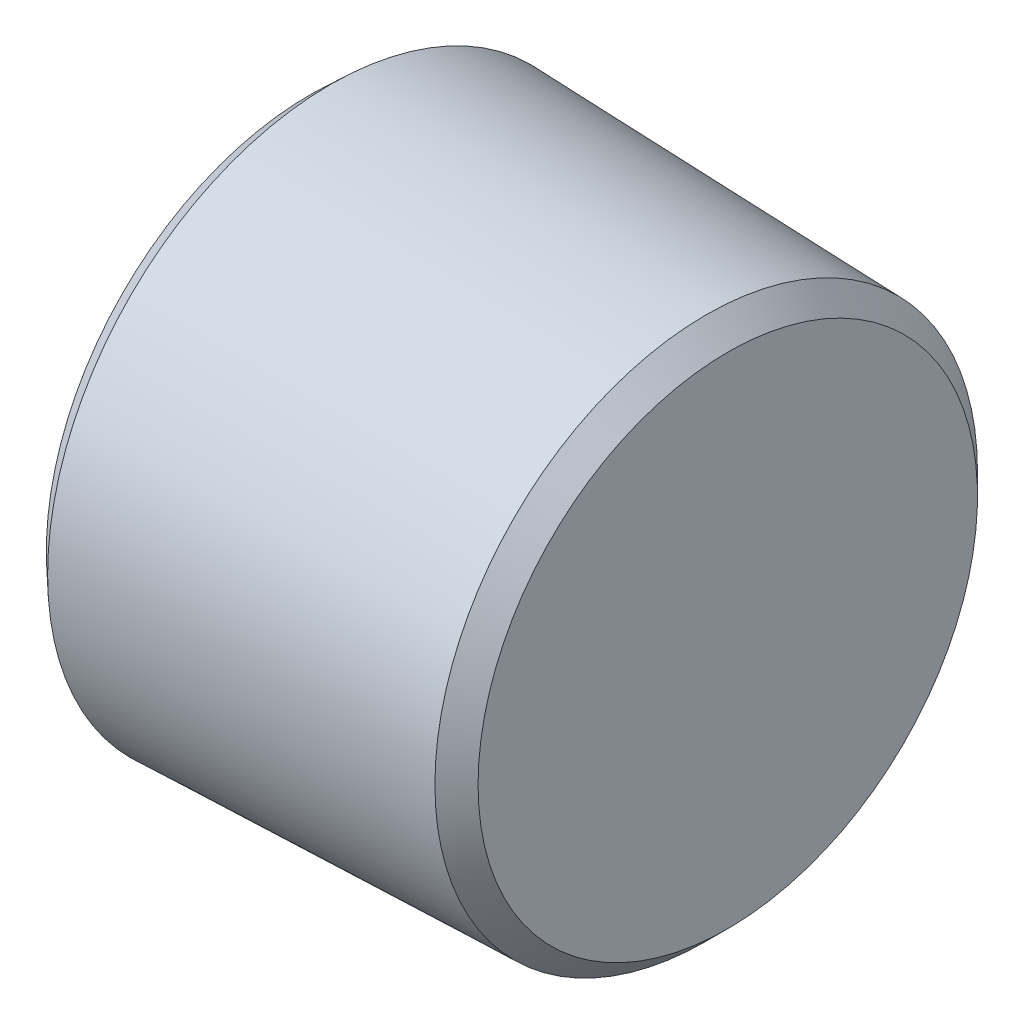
ISO-10303-21;
HEADER;
FILE_DESCRIPTION(('STEP AP214'),'2;1');
FILE_NAME('part.step','',(''),(''),'','','');
FILE_SCHEMA(('AUTOMOTIVE_DESIGN { 1 0 10303 214 1 1 1 1 }'));
ENDSEC;
DATA;
#1=APPLICATION_CONTEXT('core data for automotive mechanical design processes');
#2=APPLICATION_PROTOCOL_DEFINITION('international standard','automotive_design',2000,#1);
#3=PRODUCT_CONTEXT('',#1,'mechanical');
#4=PRODUCT('Part','Part','',(#3));
#5=PRODUCT_RELATED_PRODUCT_CATEGORY('part','',(#4));
#6=PRODUCT_DEFINITION_FORMATION('','',#4);
#7=PRODUCT_DEFINITION_CONTEXT('part definition',#1,'design');
#8=PRODUCT_DEFINITION('design','',#6,#7);
#9=PRODUCT_DEFINITION_SHAPE('','',#8);
#10=(LENGTH_UNIT() NAMED_UNIT(*) SI_UNIT(.MILLI.,.METRE.));
#11=(NAMED_UNIT(*) PLANE_ANGLE_UNIT() SI_UNIT($,.RADIAN.));
#12=(NAMED_UNIT(*) SI_UNIT($,.STERADIAN.) SOLID_ANGLE_UNIT());
#13=UNCERTAINTY_MEASURE_WITH_UNIT(LENGTH_MEASURE(1.E-05),#10,'distance_accuracy_value','');
#14=(GEOMETRIC_REPRESENTATION_CONTEXT(3) GLOBAL_UNCERTAINTY_ASSIGNED_CONTEXT((#13)) GLOBAL_UNIT_ASSIGNED_CONTEXT((#10,
#11,#12)) REPRESENTATION_CONTEXT('',''));
#15=CARTESIAN_POINT('',(0.,0.,0.));
#16=DIRECTION('',(0.,0.,1.));
#17=DIRECTION('',(1.,0.,0.));
#18=AXIS2_PLACEMENT_3D('',#15,#16,#17);
#19=CARTESIAN_POINT('',(3.5,1.73205080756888,-3.));
#20=DIRECTION('',(-1.,0.,0.));
#21=DIRECTION('',(0.,0.,1.));
#22=AXIS2_PLACEMENT_3D('',#19,#20,#21);
#23=PLANE('',#22);
#24=CARTESIAN_POINT('',(3.5,0.,0.));
#25=DIRECTION('',(-1.,0.,0.));
#26=DIRECTION('',(0.,0.,1.));
#27=AXIS2_PLACEMENT_3D('',#24,#25,#26);
#28=CIRCLE('',#27,3.);
#29=CARTESIAN_POINT('',(3.5,0.,3.));
#30=VERTEX_POINT('',#29);
#31=CARTESIAN_POINT('',(3.5,2.59807621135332,1.5));
#32=VERTEX_POINT('',#31);
#33=EDGE_CURVE('E109',#30,#32,#28,.T.);
#34=ORIENTED_EDGE('',*,*,#33,.F.);
#35=DIRECTION('',(0.,-1.,0.));
#36=VECTOR('',#35,1.);
#37=CARTESIAN_POINT('',(3.5,1.73205080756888,3.));
#38=LINE('',#37,#36);
#39=CARTESIAN_POINT('',(3.5,1.73205080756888,3.));
#40=VERTEX_POINT('',#39);
#41=EDGE_CURVE('E132',#40,#30,#38,.T.);
#42=ORIENTED_EDGE('',*,*,#41,.F.);
#43=DIRECTION('',(0.,-0.5,0.866025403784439));
#44=VECTOR('',#43,1.);
#45=CARTESIAN_POINT('',(3.5,3.46410161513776,0.));
#46=LINE('',#45,#44);
#47=EDGE_CURVE('E130',#32,#40,#46,.T.);
#48=ORIENTED_EDGE('',*,*,#47,.F.);
#49=EDGE_LOOP('',(#34,#42,#48));
#50=FACE_BOUND('',#49,.T.);
#51=ADVANCED_FACE('F29',(#50),#23,.T.);
#52=CARTESIAN_POINT('',(3.5,2.59807621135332,-1.5));
#53=VERTEX_POINT('',#52);
#54=EDGE_CURVE('E111',#32,#53,#28,.T.);
#55=ORIENTED_EDGE('',*,*,#54,.F.);
#56=CARTESIAN_POINT('',(3.5,3.46410161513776,0.));
#57=VERTEX_POINT('',#56);
#58=EDGE_CURVE('E124',#57,#32,#46,.T.);
#59=ORIENTED_EDGE('',*,*,#58,.F.);
#60=DIRECTION('',(0.,0.5,0.866025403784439));
#61=VECTOR('',#60,1.);
#62=CARTESIAN_POINT('',(3.5,1.73205080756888,-3.));
#63=LINE('',#62,#61);
#64=EDGE_CURVE('E126',#53,#57,#63,.T.);
#65=ORIENTED_EDGE('',*,*,#64,.F.);
#66=EDGE_LOOP('',(#55,#59,#65));
#67=FACE_BOUND('',#66,.T.);
#68=ADVANCED_FACE('F122',(#67),#23,.T.);
#69=CARTESIAN_POINT('',(3.5,0.,-3.));
#70=VERTEX_POINT('',#69);
#71=EDGE_CURVE('E129',#53,#70,#28,.T.);
#72=ORIENTED_EDGE('',*,*,#71,.F.);
#73=CARTESIAN_POINT('',(3.5,1.73205080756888,-3.));
#74=VERTEX_POINT('',#73);
#75=EDGE_CURVE('E135',#74,#53,#63,.T.);
#76=ORIENTED_EDGE('',*,*,#75,.F.);
#77=DIRECTION('',(0.,1.,0.));
#78=VECTOR('',#77,1.);
#79=CARTESIAN_POINT('',(3.5,-1.73205080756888,-3.));
#80=LINE('',#79,#78);
#81=EDGE_CURVE('E152',#70,#74,#80,.T.);
#82=ORIENTED_EDGE('',*,*,#81,.F.);
#83=EDGE_LOOP('',(#72,#76,#82));
#84=FACE_BOUND('',#83,.T.);
#85=ADVANCED_FACE('F215',(#84),#23,.T.);
#86=CARTESIAN_POINT('',(3.5,-2.59807621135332,-1.5));
#87=VERTEX_POINT('',#86);
#88=EDGE_CURVE('E217',#70,#87,#28,.T.);
#89=ORIENTED_EDGE('',*,*,#88,.F.);
#90=CARTESIAN_POINT('',(3.5,-1.73205080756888,-3.));
#91=VERTEX_POINT('',#90);
#92=EDGE_CURVE('E153',#91,#70,#80,.T.);
#93=ORIENTED_EDGE('',*,*,#92,.F.);
#94=DIRECTION('',(0.,0.5,-0.866025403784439));
#95=VECTOR('',#94,1.);
#96=CARTESIAN_POINT('',(3.5,-3.46410161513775,0.));
#97=LINE('',#96,#95);
#98=EDGE_CURVE('E148',#87,#91,#97,.T.);
#99=ORIENTED_EDGE('',*,*,#98,.F.);
#100=EDGE_LOOP('',(#89,#93,#99));
#101=FACE_BOUND('',#100,.T.);
#102=ADVANCED_FACE('F224',(#101),#23,.T.);
#103=CARTESIAN_POINT('',(3.5,-2.59807621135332,1.5));
#104=VERTEX_POINT('',#103);
#105=EDGE_CURVE('E44',#87,#104,#28,.T.);
#106=ORIENTED_EDGE('',*,*,#105,.F.);
#107=CARTESIAN_POINT('',(3.5,-3.46410161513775,0.));
#108=VERTEX_POINT('',#107);
#109=EDGE_CURVE('E149',#108,#87,#97,.T.);
#110=ORIENTED_EDGE('',*,*,#109,.F.);
#111=DIRECTION('',(0.,-0.5,-0.866025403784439));
#112=VECTOR('',#111,1.);
#113=CARTESIAN_POINT('',(3.5,-1.73205080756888,3.));
#114=LINE('',#113,#112);
#115=EDGE_CURVE('E144',#104,#108,#114,.T.);
#116=ORIENTED_EDGE('',*,*,#115,.F.);
#117=EDGE_LOOP('',(#106,#110,#116));
#118=FACE_BOUND('',#117,.T.);
#119=ADVANCED_FACE('F194',(#118),#23,.T.);
#120=CARTESIAN_POINT('',(0.,0.,0.));
#121=DIRECTION('',(1.,0.,0.));
#122=DIRECTION('',(0.,0.,-1.));
#123=AXIS2_PLACEMENT_3D('',#120,#121,#122);
#124=PLANE('',#123);
#125=CARTESIAN_POINT('',(0.,0.,0.));
#126=DIRECTION('',(1.,0.,0.));
#127=DIRECTION('',(0.,0.,-1.));
#128=AXIS2_PLACEMENT_3D('',#125,#126,#127);
#129=CIRCLE('',#128,6.30091483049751);
#130=CARTESIAN_POINT('',(0.,0.,-6.30091483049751));
#131=VERTEX_POINT('',#130);
#132=EDGE_CURVE('E11',#131,#131,#129,.F.);
#133=ORIENTED_EDGE('',*,*,#132,.T.);
#134=EDGE_LOOP('',(#133));
#135=FACE_BOUND('',#134,.T.);
#136=DIRECTION('',(0.,0.5,0.866025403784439));
#137=VECTOR('',#136,1.);
#138=CARTESIAN_POINT('',(0.,1.73205080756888,-3.));
#139=LINE('',#138,#137);
#140=CARTESIAN_POINT('',(0.,1.73205080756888,-3.));
#141=VERTEX_POINT('',#140);
#142=CARTESIAN_POINT('',(0.,3.46410161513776,0.));
#143=VERTEX_POINT('',#142);
#144=EDGE_CURVE('E52',#141,#143,#139,.T.);
#145=ORIENTED_EDGE('',*,*,#144,.T.);
#146=DIRECTION('',(0.,-0.5,0.866025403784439));
#147=VECTOR('',#146,1.);
#148=CARTESIAN_POINT('',(0.,3.46410161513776,0.));
#149=LINE('',#148,#147);
#150=CARTESIAN_POINT('',(0.,1.73205080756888,3.));
#151=VERTEX_POINT('',#150);
#152=EDGE_CURVE('E198',#143,#151,#149,.T.);
#153=ORIENTED_EDGE('',*,*,#152,.T.);
#154=DIRECTION('',(0.,-1.,0.));
#155=VECTOR('',#154,1.);
#156=CARTESIAN_POINT('',(0.,1.73205080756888,3.));
#157=LINE('',#156,#155);
#158=CARTESIAN_POINT('',(0.,-1.73205080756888,3.));
#159=VERTEX_POINT('',#158);
#160=EDGE_CURVE('E203',#151,#159,#157,.T.);
#161=ORIENTED_EDGE('',*,*,#160,.T.);
#162=DIRECTION('',(0.,-0.5,-0.866025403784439));
#163=VECTOR('',#162,1.);
#164=CARTESIAN_POINT('',(0.,-1.73205080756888,3.));
#165=LINE('',#164,#163);
#166=CARTESIAN_POINT('',(0.,-3.46410161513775,0.));
#167=VERTEX_POINT('',#166);
#168=EDGE_CURVE('E207',#159,#167,#165,.T.);
#169=ORIENTED_EDGE('',*,*,#168,.T.);
#170=DIRECTION('',(0.,0.5,-0.866025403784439));
#171=VECTOR('',#170,1.);
#172=CARTESIAN_POINT('',(0.,-3.46410161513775,0.));
#173=LINE('',#172,#171);
#174=CARTESIAN_POINT('',(0.,-1.73205080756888,-3.));
#175=VERTEX_POINT('',#174);
#176=EDGE_CURVE('E210',#167,#175,#173,.T.);
#177=ORIENTED_EDGE('',*,*,#176,.T.);
#178=DIRECTION('',(0.,1.,0.));
#179=VECTOR('',#178,1.);
#180=CARTESIAN_POINT('',(0.,-1.73205080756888,-3.));
#181=LINE('',#180,#179);
#182=EDGE_CURVE('E201',#175,#141,#181,.T.);
#183=ORIENTED_EDGE('',*,*,#182,.T.);
#184=EDGE_LOOP('',(#145,#153,#161,#169,#177,#183));
#185=FACE_BOUND('',#184,.T.);
#186=ADVANCED_FACE('F31',(#135,#185),#124,.F.);
#187=CARTESIAN_POINT('',(10.,0.,0.));
#188=DIRECTION('',(-1.,0.,0.));
#189=DIRECTION('',(0.,0.,1.));
#190=AXIS2_PLACEMENT_3D('',#187,#188,#189);
#191=CONICAL_SURFACE('',#190,6.47350000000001,0.0312398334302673);
#192=CARTESIAN_POINT('',(9.48387096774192,0.,0.));
#193=DIRECTION('',(1.,0.,0.));
#194=DIRECTION('',(0.,0.,-1.));
#195=AXIS2_PLACEMENT_3D('',#192,#193,#194);
#196=CIRCLE('',#195,6.48962903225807);
#197=CARTESIAN_POINT('',(9.48387096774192,0.,-6.48962903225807));
#198=VERTEX_POINT('',#197);
#199=EDGE_CURVE('E169',#198,#198,#196,.F.);
#200=ORIENTED_EDGE('',*,*,#199,.T.);
#201=EDGE_LOOP('',(#200));
#202=FACE_BOUND('',#201,.T.);
#203=CARTESIAN_POINT('',(0.499756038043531,0.,0.));
#204=DIRECTION('',(1.,0.,0.));
#205=DIRECTION('',(0.,0.,-1.));
#206=AXIS2_PLACEMENT_3D('',#203,#204,#205);
#207=CIRCLE('',#206,6.77038262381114);
#208=CARTESIAN_POINT('',(0.499756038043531,0.,-6.77038262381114));
#209=VERTEX_POINT('',#208);
#210=EDGE_CURVE('E128',#209,#209,#207,.T.);
#211=ORIENTED_EDGE('',*,*,#210,.T.);
#212=EDGE_LOOP('',(#211));
#213=FACE_BOUND('',#212,.T.);
#214=ADVANCED_FACE('F182',(#202,#213),#191,.T.);
#215=CARTESIAN_POINT('',(10.,6.47350000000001,0.));
#216=DIRECTION('',(-1.,0.,0.));
#217=DIRECTION('',(0.,0.,1.));
#218=AXIS2_PLACEMENT_3D('',#215,#216,#217);
#219=PLANE('',#218);
#220=CARTESIAN_POINT('',(10.,0.,0.));
#221=DIRECTION('',(-1.,0.,0.));
#222=DIRECTION('',(0.,0.,1.));
#223=AXIS2_PLACEMENT_3D('',#220,#221,#222);
#224=CIRCLE('',#223,5.97350000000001);
#225=CARTESIAN_POINT('',(10.,0.,5.97350000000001));
#226=VERTEX_POINT('',#225);
#227=EDGE_CURVE('E37',#226,#226,#224,.F.);
#228=ORIENTED_EDGE('',*,*,#227,.T.);
#229=EDGE_LOOP('',(#228));
#230=FACE_BOUND('',#229,.T.);
#231=ADVANCED_FACE('F174',(#230),#219,.F.);
#232=CARTESIAN_POINT('',(3.5,1.73205080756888,-3.));
#233=DIRECTION('',(0.,-0.866025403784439,0.5));
#234=DIRECTION('',(0.,-0.5,-0.866025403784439));
#235=AXIS2_PLACEMENT_3D('',#232,#233,#234);
#236=PLANE('',#235);
#237=ORIENTED_EDGE('',*,*,#144,.F.);
#238=DIRECTION('',(-1.,0.,0.));
#239=VECTOR('',#238,1.);
#240=CARTESIAN_POINT('',(3.5,1.73205080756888,-3.));
#241=LINE('',#240,#239);
#242=EDGE_CURVE('E156',#74,#141,#241,.T.);
#243=ORIENTED_EDGE('',*,*,#242,.F.);
#244=ORIENTED_EDGE('',*,*,#75,.T.);
#245=ORIENTED_EDGE('',*,*,#64,.T.);
#246=DIRECTION('',(-1.,0.,0.));
#247=VECTOR('',#246,1.);
#248=CARTESIAN_POINT('',(3.5,3.46410161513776,0.));
#249=LINE('',#248,#247);
#250=EDGE_CURVE('E138',#57,#143,#249,.T.);
#251=ORIENTED_EDGE('',*,*,#250,.T.);
#252=EDGE_LOOP('',(#237,#243,#244,#245,#251));
#253=FACE_BOUND('',#252,.T.);
#254=ADVANCED_FACE('F212',(#253),#236,.T.);
#255=CARTESIAN_POINT('',(3.5,3.46410161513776,0.));
#256=DIRECTION('',(0.,-0.866025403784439,-0.5));
#257=DIRECTION('',(0.,0.5,-0.866025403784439));
#258=AXIS2_PLACEMENT_3D('',#255,#256,#257);
#259=PLANE('',#258);
#260=ORIENTED_EDGE('',*,*,#152,.F.);
#261=ORIENTED_EDGE('',*,*,#250,.F.);
#262=ORIENTED_EDGE('',*,*,#58,.T.);
#263=ORIENTED_EDGE('',*,*,#47,.T.);
#264=DIRECTION('',(-1.,0.,0.));
#265=VECTOR('',#264,1.);
#266=CARTESIAN_POINT('',(3.5,1.73205080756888,3.));
#267=LINE('',#266,#265);
#268=EDGE_CURVE('E164',#40,#151,#267,.T.);
#269=ORIENTED_EDGE('',*,*,#268,.T.);
#270=EDGE_LOOP('',(#260,#261,#262,#263,#269));
#271=FACE_BOUND('',#270,.T.);
#272=ADVANCED_FACE('F137',(#271),#259,.T.);
#273=CARTESIAN_POINT('',(3.5,1.73205080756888,3.));
#274=DIRECTION('',(0.,0.,-1.));
#275=DIRECTION('',(-1.,0.,0.));
#276=AXIS2_PLACEMENT_3D('',#273,#274,#275);
#277=PLANE('',#276);
#278=ORIENTED_EDGE('',*,*,#160,.F.);
#279=ORIENTED_EDGE('',*,*,#268,.F.);
#280=ORIENTED_EDGE('',*,*,#41,.T.);
#281=CARTESIAN_POINT('',(3.5,-1.73205080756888,3.));
#282=VERTEX_POINT('',#281);
#283=EDGE_CURVE('E139',#30,#282,#38,.T.);
#284=ORIENTED_EDGE('',*,*,#283,.T.);
#285=DIRECTION('',(-1.,0.,0.));
#286=VECTOR('',#285,1.);
#287=CARTESIAN_POINT('',(3.5,-1.73205080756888,3.));
#288=LINE('',#287,#286);
#289=EDGE_CURVE('E162',#282,#159,#288,.T.);
#290=ORIENTED_EDGE('',*,*,#289,.T.);
#291=EDGE_LOOP('',(#278,#279,#280,#284,#290));
#292=FACE_BOUND('',#291,.T.);
#293=ADVANCED_FACE('F238',(#292),#277,.T.);
#294=CARTESIAN_POINT('',(3.5,-1.73205080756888,3.));
#295=DIRECTION('',(0.,0.866025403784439,-0.5));
#296=DIRECTION('',(0.,0.5,0.866025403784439));
#297=AXIS2_PLACEMENT_3D('',#294,#295,#296);
#298=PLANE('',#297);
#299=ORIENTED_EDGE('',*,*,#168,.F.);
#300=ORIENTED_EDGE('',*,*,#289,.F.);
#301=EDGE_CURVE('E145',#282,#104,#114,.T.);
#302=ORIENTED_EDGE('',*,*,#301,.T.);
#303=ORIENTED_EDGE('',*,*,#115,.T.);
#304=DIRECTION('',(-1.,0.,0.));
#305=VECTOR('',#304,1.);
#306=CARTESIAN_POINT('',(3.5,-3.46410161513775,0.));
#307=LINE('',#306,#305);
#308=EDGE_CURVE('E160',#108,#167,#307,.T.);
#309=ORIENTED_EDGE('',*,*,#308,.T.);
#310=EDGE_LOOP('',(#299,#300,#302,#303,#309));
#311=FACE_BOUND('',#310,.T.);
#312=ADVANCED_FACE('F232',(#311),#298,.T.);
#313=CARTESIAN_POINT('',(3.5,-3.46410161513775,0.));
#314=DIRECTION('',(0.,0.866025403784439,0.5));
#315=DIRECTION('',(0.,-0.5,0.866025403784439));
#316=AXIS2_PLACEMENT_3D('',#313,#314,#315);
#317=PLANE('',#316);
#318=ORIENTED_EDGE('',*,*,#176,.F.);
#319=ORIENTED_EDGE('',*,*,#308,.F.);
#320=ORIENTED_EDGE('',*,*,#109,.T.);
#321=ORIENTED_EDGE('',*,*,#98,.T.);
#322=DIRECTION('',(-1.,0.,0.));
#323=VECTOR('',#322,1.);
#324=CARTESIAN_POINT('',(3.5,-1.73205080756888,-3.));
#325=LINE('',#324,#323);
#326=EDGE_CURVE('E158',#91,#175,#325,.T.);
#327=ORIENTED_EDGE('',*,*,#326,.T.);
#328=EDGE_LOOP('',(#318,#319,#320,#321,#327));
#329=FACE_BOUND('',#328,.T.);
#330=ADVANCED_FACE('F229',(#329),#317,.T.);
#331=CARTESIAN_POINT('',(3.5,-1.73205080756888,-3.));
#332=DIRECTION('',(0.,0.,1.));
#333=DIRECTION('',(0.,-1.,0.));
#334=AXIS2_PLACEMENT_3D('',#331,#332,#333);
#335=PLANE('',#334);
#336=ORIENTED_EDGE('',*,*,#182,.F.);
#337=ORIENTED_EDGE('',*,*,#326,.F.);
#338=ORIENTED_EDGE('',*,*,#92,.T.);
#339=ORIENTED_EDGE('',*,*,#81,.T.);
#340=ORIENTED_EDGE('',*,*,#242,.T.);
#341=EDGE_LOOP('',(#336,#337,#338,#339,#340));
#342=FACE_BOUND('',#341,.T.);
#343=ADVANCED_FACE('F254',(#342),#335,.T.);
#344=EDGE_CURVE('E113',#104,#30,#28,.T.);
#345=ORIENTED_EDGE('',*,*,#344,.F.);
#346=ORIENTED_EDGE('',*,*,#301,.F.);
#347=ORIENTED_EDGE('',*,*,#283,.F.);
#348=EDGE_LOOP('',(#345,#346,#347));
#349=FACE_BOUND('',#348,.T.);
#350=ADVANCED_FACE('F106',(#349),#23,.T.);
#351=CARTESIAN_POINT('',(3.5,0.,0.));
#352=DIRECTION('',(-1.,0.,0.));
#353=DIRECTION('',(0.,0.,1.));
#354=AXIS2_PLACEMENT_3D('',#351,#352,#353);
#355=CONICAL_SURFACE('',#354,3.,1.04719755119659);
#356=CARTESIAN_POINT('',(5.2320508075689,0.,0.));
#357=VERTEX_POINT('',#356);
#358=VERTEX_LOOP('',#357);
#359=FACE_BOUND('',#358,.T.);
#360=ORIENTED_EDGE('',*,*,#33,.T.);
#361=ORIENTED_EDGE('',*,*,#54,.T.);
#362=ORIENTED_EDGE('',*,*,#71,.T.);
#363=ORIENTED_EDGE('',*,*,#88,.T.);
#364=ORIENTED_EDGE('',*,*,#105,.T.);
#365=ORIENTED_EDGE('',*,*,#344,.T.);
#366=EDGE_LOOP('',(#360,#361,#362,#363,#364,#365));
#367=FACE_BOUND('',#366,.T.);
#368=ADVANCED_FACE('F103',(#359,#367),#355,.F.);
#369=CARTESIAN_POINT('',(9.48387096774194,0.,0.));
#370=DIRECTION('',(-1.,0.,0.));
#371=DIRECTION('',(0.,0.,1.));
#372=AXIS2_PLACEMENT_3D('',#369,#370,#371);
#373=CONICAL_SURFACE('',#372,6.48962903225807,0.785398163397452);
#374=ORIENTED_EDGE('',*,*,#227,.F.);
#375=EDGE_LOOP('',(#374));
#376=FACE_BOUND('',#375,.T.);
#377=ORIENTED_EDGE('',*,*,#199,.F.);
#378=EDGE_LOOP('',(#377));
#379=FACE_BOUND('',#378,.T.);
#380=ADVANCED_FACE('F105',(#376,#379),#373,.T.);
#381=CARTESIAN_POINT('',(0.,0.,0.));
#382=DIRECTION('',(1.,0.,0.));
#383=DIRECTION('',(0.,0.,-1.));
#384=AXIS2_PLACEMENT_3D('',#381,#382,#383);
#385=CONICAL_SURFACE('',#384,6.30091483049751,0.754158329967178);
#386=ORIENTED_EDGE('',*,*,#210,.F.);
#387=EDGE_LOOP('',(#386));
#388=FACE_BOUND('',#387,.T.);
#389=ORIENTED_EDGE('',*,*,#132,.F.);
#390=EDGE_LOOP('',(#389));
#391=FACE_BOUND('',#390,.T.);
#392=ADVANCED_FACE('F178',(#388,#391),#385,.T.);
#393=CLOSED_SHELL('',(#51,#68,#85,#102,#119,#186,#214,#231,#254,#272,#293,#312,#330,#343,#350,
#368,#380,#392));
#394=MANIFOLD_SOLID_BREP('B2',#393);
#395=ADVANCED_BREP_SHAPE_REPRESENTATION('',(#18,#394),#14);
#396=SHAPE_DEFINITION_REPRESENTATION(#9,#395);
ENDSEC;
END-ISO-10303-21;
